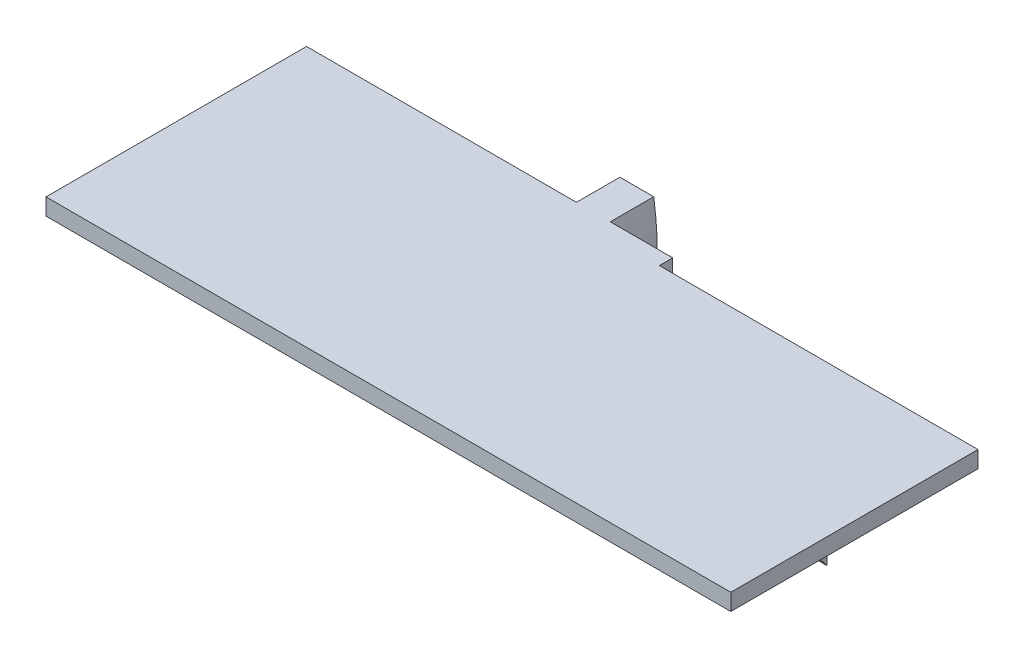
ISO-10303-21;
HEADER;
FILE_DESCRIPTION(('STEP AP214'),'2;1');
FILE_NAME('part.step','',(''),(''),'','','');
FILE_SCHEMA(('AUTOMOTIVE_DESIGN { 1 0 10303 214 1 1 1 1 }'));
ENDSEC;
DATA;
#1=APPLICATION_CONTEXT('core data for automotive mechanical design processes');
#2=APPLICATION_PROTOCOL_DEFINITION('international standard','automotive_design',2000,#1);
#3=PRODUCT_CONTEXT('',#1,'mechanical');
#4=PRODUCT('Part','Part','',(#3));
#5=PRODUCT_RELATED_PRODUCT_CATEGORY('part','',(#4));
#6=PRODUCT_DEFINITION_FORMATION('','',#4);
#7=PRODUCT_DEFINITION_CONTEXT('part definition',#1,'design');
#8=PRODUCT_DEFINITION('design','',#6,#7);
#9=PRODUCT_DEFINITION_SHAPE('','',#8);
#10=(LENGTH_UNIT() NAMED_UNIT(*) SI_UNIT(.MILLI.,.METRE.));
#11=(NAMED_UNIT(*) PLANE_ANGLE_UNIT() SI_UNIT($,.RADIAN.));
#12=(NAMED_UNIT(*) SI_UNIT($,.STERADIAN.) SOLID_ANGLE_UNIT());
#13=UNCERTAINTY_MEASURE_WITH_UNIT(LENGTH_MEASURE(1.E-05),#10,'distance_accuracy_value','');
#14=(GEOMETRIC_REPRESENTATION_CONTEXT(3) GLOBAL_UNCERTAINTY_ASSIGNED_CONTEXT((#13)) GLOBAL_UNIT_ASSIGNED_CONTEXT((#10,
#11,#12)) REPRESENTATION_CONTEXT('',''));
#15=CARTESIAN_POINT('',(0.,0.,0.));
#16=DIRECTION('',(0.,0.,1.));
#17=DIRECTION('',(1.,0.,0.));
#18=AXIS2_PLACEMENT_3D('',#15,#16,#17);
#19=CARTESIAN_POINT('',(-102.5,-9.,-52.));
#20=DIRECTION('',(0.,0.,1.));
#21=DIRECTION('',(1.,0.,0.));
#22=AXIS2_PLACEMENT_3D('',#19,#20,#21);
#23=CYLINDRICAL_SURFACE('',#22,82.);
#24=DIRECTION('',(0.,0.,1.));
#25=VECTOR('',#24,1.);
#26=CARTESIAN_POINT('',(-21.7039604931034,5.,-52.));
#27=LINE('',#26,#25);
#28=CARTESIAN_POINT('',(-21.7039604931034,5.,-47.));
#29=VERTEX_POINT('',#28);
#30=CARTESIAN_POINT('',(-21.7039604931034,5.,-39.));
#31=VERTEX_POINT('',#30);
#32=EDGE_CURVE('E255',#29,#31,#27,.T.);
#33=ORIENTED_EDGE('',*,*,#32,.F.);
#34=CARTESIAN_POINT('',(-102.5,-9.,-47.));
#35=DIRECTION('',(0.,0.,-1.));
#36=DIRECTION('',(-1.,0.,0.));
#37=AXIS2_PLACEMENT_3D('',#34,#35,#36);
#38=CIRCLE('',#37,82.);
#39=CARTESIAN_POINT('',(-20.5,-9.,-47.));
#40=VERTEX_POINT('',#39);
#41=EDGE_CURVE('E60',#29,#40,#38,.T.);
#42=ORIENTED_EDGE('',*,*,#41,.T.);
#43=DIRECTION('',(0.,0.,1.));
#44=VECTOR('',#43,1.);
#45=CARTESIAN_POINT('',(-20.5,-9.,-52.));
#46=LINE('',#45,#44);
#47=CARTESIAN_POINT('',(-20.5,-9.,-39.));
#48=VERTEX_POINT('',#47);
#49=EDGE_CURVE('E244',#40,#48,#46,.T.);
#50=ORIENTED_EDGE('',*,*,#49,.T.);
#51=CARTESIAN_POINT('',(-102.5,-9.,-39.));
#52=DIRECTION('',(0.,0.,-1.));
#53=DIRECTION('',(-1.,0.,0.));
#54=AXIS2_PLACEMENT_3D('',#51,#52,#53);
#55=CIRCLE('',#54,82.);
#56=CARTESIAN_POINT('',(-20.995398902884,0.,-39.));
#57=VERTEX_POINT('',#56);
#58=EDGE_CURVE('E239',#57,#48,#55,.T.);
#59=ORIENTED_EDGE('',*,*,#58,.F.);
#60=EDGE_CURVE('E230',#31,#57,#55,.T.);
#61=ORIENTED_EDGE('',*,*,#60,.F.);
#62=EDGE_LOOP('',(#33,#42,#50,#59,#61));
#63=FACE_BOUND('',#62,.T.);
#64=ADVANCED_FACE('F37',(#63),#23,.F.);
#65=CARTESIAN_POINT('',(102.5,5.,-39.));
#66=DIRECTION('',(0.,0.,1.));
#67=DIRECTION('',(1.,0.,0.));
#68=AXIS2_PLACEMENT_3D('',#65,#66,#67);
#69=PLANE('',#68);
#70=DIRECTION('',(-1.,0.,0.));
#71=VECTOR('',#70,1.);
#72=CARTESIAN_POINT('',(102.5,5.,-39.));
#73=LINE('',#72,#71);
#74=CARTESIAN_POINT('',(-102.5,5.,-39.));
#75=VERTEX_POINT('',#74);
#76=EDGE_CURVE('E198',#31,#75,#73,.T.);
#77=ORIENTED_EDGE('',*,*,#76,.F.);
#78=ORIENTED_EDGE('',*,*,#60,.T.);
#79=DIRECTION('',(-1.,0.,0.));
#80=VECTOR('',#79,1.);
#81=CARTESIAN_POINT('',(102.5,0.,-39.));
#82=LINE('',#81,#80);
#83=CARTESIAN_POINT('',(-102.5,0.,-39.));
#84=VERTEX_POINT('',#83);
#85=EDGE_CURVE('E209',#57,#84,#82,.T.);
#86=ORIENTED_EDGE('',*,*,#85,.T.);
#87=DIRECTION('',(0.,-1.,0.));
#88=VECTOR('',#87,1.);
#89=CARTESIAN_POINT('',(-102.5,5.,-39.));
#90=LINE('',#89,#88);
#91=EDGE_CURVE('E202',#75,#84,#90,.T.);
#92=ORIENTED_EDGE('',*,*,#91,.F.);
#93=EDGE_LOOP('',(#77,#78,#86,#92));
#94=FACE_BOUND('',#93,.T.);
#95=ADVANCED_FACE('F228',(#94),#69,.F.);
#96=CARTESIAN_POINT('',(102.5,5.,39.));
#97=DIRECTION('',(-1.,0.,0.));
#98=DIRECTION('',(0.,0.,1.));
#99=AXIS2_PLACEMENT_3D('',#96,#97,#98);
#100=PLANE('',#99);
#101=DIRECTION('',(0.,1.,0.));
#102=VECTOR('',#101,1.);
#103=CARTESIAN_POINT('',(102.5,0.,-35.));
#104=LINE('',#103,#102);
#105=CARTESIAN_POINT('',(102.5,0.,-35.));
#106=VERTEX_POINT('',#105);
#107=CARTESIAN_POINT('',(102.5,5.,-35.));
#108=VERTEX_POINT('',#107);
#109=EDGE_CURVE('E169',#106,#108,#104,.T.);
#110=ORIENTED_EDGE('',*,*,#109,.T.);
#111=DIRECTION('',(0.,0.,-1.));
#112=VECTOR('',#111,1.);
#113=CARTESIAN_POINT('',(102.5,5.,39.));
#114=LINE('',#113,#112);
#115=CARTESIAN_POINT('',(102.5,5.,39.));
#116=VERTEX_POINT('',#115);
#117=EDGE_CURVE('E195',#116,#108,#114,.T.);
#118=ORIENTED_EDGE('',*,*,#117,.F.);
#119=DIRECTION('',(0.,-1.,0.));
#120=VECTOR('',#119,1.);
#121=CARTESIAN_POINT('',(102.5,5.,39.));
#122=LINE('',#121,#120);
#123=CARTESIAN_POINT('',(102.5,0.,39.));
#124=VERTEX_POINT('',#123);
#125=EDGE_CURVE('E45',#116,#124,#122,.T.);
#126=ORIENTED_EDGE('',*,*,#125,.T.);
#127=DIRECTION('',(0.,0.,-1.));
#128=VECTOR('',#127,1.);
#129=CARTESIAN_POINT('',(102.5,0.,39.));
#130=LINE('',#129,#128);
#131=EDGE_CURVE('E207',#124,#106,#130,.T.);
#132=ORIENTED_EDGE('',*,*,#131,.T.);
#133=EDGE_LOOP('',(#110,#118,#126,#132));
#134=FACE_BOUND('',#133,.T.);
#135=ADVANCED_FACE('F217',(#134),#100,.F.);
#136=CARTESIAN_POINT('',(0.,5.,0.));
#137=DIRECTION('',(0.,1.,0.));
#138=DIRECTION('',(0.,0.,1.));
#139=AXIS2_PLACEMENT_3D('',#136,#137,#138);
#140=PLANE('',#139);
#141=ORIENTED_EDGE('',*,*,#117,.T.);
#142=DIRECTION('',(-1.,0.,0.));
#143=VECTOR('',#142,1.);
#144=CARTESIAN_POINT('',(0.,5.,-35.));
#145=LINE('',#144,#143);
#146=CARTESIAN_POINT('',(7.09999999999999,5.,-35.));
#147=VERTEX_POINT('',#146);
#148=EDGE_CURVE('E182',#108,#147,#145,.T.);
#149=ORIENTED_EDGE('',*,*,#148,.T.);
#150=DIRECTION('',(0.,0.,1.));
#151=VECTOR('',#150,1.);
#152=CARTESIAN_POINT('',(7.10000000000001,5.,0.));
#153=LINE('',#152,#151);
#154=CARTESIAN_POINT('',(7.09999999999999,5.,-39.));
#155=VERTEX_POINT('',#154);
#156=EDGE_CURVE('E179',#155,#147,#153,.T.);
#157=ORIENTED_EDGE('',*,*,#156,.F.);
#158=CARTESIAN_POINT('',(-11.5714566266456,5.,-39.));
#159=VERTEX_POINT('',#158);
#160=EDGE_CURVE('E199',#155,#159,#73,.T.);
#161=ORIENTED_EDGE('',*,*,#160,.T.);
#162=DIRECTION('',(0.,0.,1.));
#163=VECTOR('',#162,1.);
#164=CARTESIAN_POINT('',(-11.5714566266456,5.,-52.));
#165=LINE('',#164,#163);
#166=CARTESIAN_POINT('',(-11.5714566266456,5.,-52.));
#167=VERTEX_POINT('',#166);
#168=EDGE_CURVE('E183',#167,#159,#165,.T.);
#169=ORIENTED_EDGE('',*,*,#168,.F.);
#170=DIRECTION('',(1.,0.,0.));
#171=VECTOR('',#170,1.);
#172=CARTESIAN_POINT('',(0.,5.,-52.));
#173=LINE('',#172,#171);
#174=CARTESIAN_POINT('',(-21.7039604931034,5.,-52.));
#175=VERTEX_POINT('',#174);
#176=EDGE_CURVE('E247',#175,#167,#173,.T.);
#177=ORIENTED_EDGE('',*,*,#176,.F.);
#178=EDGE_CURVE('E252',#175,#29,#27,.T.);
#179=ORIENTED_EDGE('',*,*,#178,.T.);
#180=ORIENTED_EDGE('',*,*,#32,.T.);
#181=ORIENTED_EDGE('',*,*,#76,.T.);
#182=DIRECTION('',(0.,0.,1.));
#183=VECTOR('',#182,1.);
#184=CARTESIAN_POINT('',(-102.5,5.,39.));
#185=LINE('',#184,#183);
#186=CARTESIAN_POINT('',(-102.5,5.,39.));
#187=VERTEX_POINT('',#186);
#188=EDGE_CURVE('E189',#75,#187,#185,.T.);
#189=ORIENTED_EDGE('',*,*,#188,.T.);
#190=DIRECTION('',(1.,0.,0.));
#191=VECTOR('',#190,1.);
#192=CARTESIAN_POINT('',(102.5,5.,39.));
#193=LINE('',#192,#191);
#194=EDGE_CURVE('E192',#187,#116,#193,.T.);
#195=ORIENTED_EDGE('',*,*,#194,.T.);
#196=EDGE_LOOP('',(#141,#149,#157,#161,#169,#177,#179,#180,#181,#189,#195));
#197=FACE_BOUND('',#196,.T.);
#198=ADVANCED_FACE('F267',(#197),#140,.T.);
#199=CARTESIAN_POINT('',(0.,0.,0.));
#200=DIRECTION('',(0.,1.,0.));
#201=DIRECTION('',(0.,0.,1.));
#202=AXIS2_PLACEMENT_3D('',#199,#200,#201);
#203=PLANE('',#202);
#204=DIRECTION('',(-1.,0.,0.));
#205=VECTOR('',#204,1.);
#206=CARTESIAN_POINT('',(57.3,0.,1.99999999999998));
#207=LINE('',#206,#205);
#208=CARTESIAN_POINT('',(57.3,0.,1.99999999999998));
#209=VERTEX_POINT('',#208);
#210=CARTESIAN_POINT('',(52.3,0.,1.99999999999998));
#211=VERTEX_POINT('',#210);
#212=EDGE_CURVE('E165',#209,#211,#207,.T.);
#213=ORIENTED_EDGE('',*,*,#212,.F.);
#214=DIRECTION('',(0.,0.,1.));
#215=VECTOR('',#214,1.);
#216=CARTESIAN_POINT('',(57.3,0.,1.99999999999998));
#217=LINE('',#216,#215);
#218=CARTESIAN_POINT('',(57.3,0.,-35.));
#219=VERTEX_POINT('',#218);
#220=EDGE_CURVE('E150',#219,#209,#217,.T.);
#221=ORIENTED_EDGE('',*,*,#220,.F.);
#222=DIRECTION('',(-1.,0.,0.));
#223=VECTOR('',#222,1.);
#224=CARTESIAN_POINT('',(0.,0.,-35.));
#225=LINE('',#224,#223);
#226=EDGE_CURVE('E162',#106,#219,#225,.T.);
#227=ORIENTED_EDGE('',*,*,#226,.F.);
#228=ORIENTED_EDGE('',*,*,#131,.F.);
#229=DIRECTION('',(1.,0.,0.));
#230=VECTOR('',#229,1.);
#231=CARTESIAN_POINT('',(102.5,0.,39.));
#232=LINE('',#231,#230);
#233=CARTESIAN_POINT('',(-102.5,0.,39.));
#234=VERTEX_POINT('',#233);
#235=EDGE_CURVE('E205',#234,#124,#232,.T.);
#236=ORIENTED_EDGE('',*,*,#235,.F.);
#237=DIRECTION('',(0.,0.,1.));
#238=VECTOR('',#237,1.);
#239=CARTESIAN_POINT('',(-102.5,0.,39.));
#240=LINE('',#239,#238);
#241=EDGE_CURVE('E187',#84,#234,#240,.T.);
#242=ORIENTED_EDGE('',*,*,#241,.F.);
#243=ORIENTED_EDGE('',*,*,#85,.F.);
#244=CARTESIAN_POINT('',(-10.9412756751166,0.,-39.));
#245=VERTEX_POINT('',#244);
#246=EDGE_CURVE('E211',#245,#57,#82,.T.);
#247=ORIENTED_EDGE('',*,*,#246,.F.);
#248=CARTESIAN_POINT('',(7.09999999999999,0.,-39.));
#249=VERTEX_POINT('',#248);
#250=EDGE_CURVE('E193',#249,#245,#82,.T.);
#251=ORIENTED_EDGE('',*,*,#250,.F.);
#252=DIRECTION('',(0.,0.,1.));
#253=VECTOR('',#252,1.);
#254=CARTESIAN_POINT('',(7.10000000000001,0.,0.));
#255=LINE('',#254,#253);
#256=CARTESIAN_POINT('',(7.09999999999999,0.,-35.));
#257=VERTEX_POINT('',#256);
#258=EDGE_CURVE('E175',#249,#257,#255,.T.);
#259=ORIENTED_EDGE('',*,*,#258,.T.);
#260=CARTESIAN_POINT('',(52.3,0.,-35.));
#261=VERTEX_POINT('',#260);
#262=EDGE_CURVE('E171',#261,#257,#225,.T.);
#263=ORIENTED_EDGE('',*,*,#262,.F.);
#264=DIRECTION('',(0.,0.,1.));
#265=VECTOR('',#264,1.);
#266=CARTESIAN_POINT('',(52.3,0.,1.99999999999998));
#267=LINE('',#266,#265);
#268=EDGE_CURVE('E296',#261,#211,#267,.T.);
#269=ORIENTED_EDGE('',*,*,#268,.T.);
#270=EDGE_LOOP('',(#213,#221,#227,#228,#236,#242,#243,#247,#251,#259,#263,#269));
#271=FACE_BOUND('',#270,.T.);
#272=ADVANCED_FACE('F160',(#271),#203,.F.);
#273=CARTESIAN_POINT('',(-102.5,5.,39.));
#274=DIRECTION('',(1.,0.,0.));
#275=DIRECTION('',(0.,0.,-1.));
#276=AXIS2_PLACEMENT_3D('',#273,#274,#275);
#277=PLANE('',#276);
#278=ORIENTED_EDGE('',*,*,#241,.T.);
#279=DIRECTION('',(0.,-1.,0.));
#280=VECTOR('',#279,1.);
#281=CARTESIAN_POINT('',(-102.5,5.,39.));
#282=LINE('',#281,#280);
#283=EDGE_CURVE('E11',#187,#234,#282,.T.);
#284=ORIENTED_EDGE('',*,*,#283,.F.);
#285=ORIENTED_EDGE('',*,*,#188,.F.);
#286=ORIENTED_EDGE('',*,*,#91,.T.);
#287=EDGE_LOOP('',(#278,#284,#285,#286));
#288=FACE_BOUND('',#287,.T.);
#289=ADVANCED_FACE('F39',(#288),#277,.F.);
#290=CARTESIAN_POINT('',(102.5,5.,39.));
#291=DIRECTION('',(0.,0.,-1.));
#292=DIRECTION('',(-1.,0.,0.));
#293=AXIS2_PLACEMENT_3D('',#290,#291,#292);
#294=PLANE('',#293);
#295=ORIENTED_EDGE('',*,*,#235,.T.);
#296=ORIENTED_EDGE('',*,*,#125,.F.);
#297=ORIENTED_EDGE('',*,*,#194,.F.);
#298=ORIENTED_EDGE('',*,*,#283,.T.);
#299=EDGE_LOOP('',(#295,#296,#297,#298));
#300=FACE_BOUND('',#299,.T.);
#301=ADVANCED_FACE('F222',(#300),#294,.F.);
#302=CARTESIAN_POINT('',(-102.5,-9.,-39.));
#303=DIRECTION('',(0.,0.,-1.));
#304=DIRECTION('',(-1.,0.,0.));
#305=AXIS2_PLACEMENT_3D('',#302,#303,#304);
#306=CIRCLE('',#305,92.);
#307=EDGE_CURVE('E248',#159,#245,#306,.T.);
#308=ORIENTED_EDGE('',*,*,#307,.F.);
#309=ORIENTED_EDGE('',*,*,#160,.F.);
#310=DIRECTION('',(0.,1.,0.));
#311=VECTOR('',#310,1.);
#312=CARTESIAN_POINT('',(7.09999999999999,0.,-39.));
#313=LINE('',#312,#311);
#314=EDGE_CURVE('E170',#249,#155,#313,.T.);
#315=ORIENTED_EDGE('',*,*,#314,.F.);
#316=ORIENTED_EDGE('',*,*,#250,.T.);
#317=EDGE_LOOP('',(#308,#309,#315,#316));
#318=FACE_BOUND('',#317,.T.);
#319=ADVANCED_FACE('F273',(#318),#69,.F.);
#320=CARTESIAN_POINT('',(0.,0.,-35.));
#321=DIRECTION('',(0.,0.,-1.));
#322=DIRECTION('',(-1.,0.,0.));
#323=AXIS2_PLACEMENT_3D('',#320,#321,#322);
#324=PLANE('',#323);
#325=ORIENTED_EDGE('',*,*,#148,.F.);
#326=ORIENTED_EDGE('',*,*,#109,.F.);
#327=ORIENTED_EDGE('',*,*,#226,.T.);
#328=DIRECTION('',(0.,1.,0.));
#329=VECTOR('',#328,1.);
#330=CARTESIAN_POINT('',(57.3,0.,-35.));
#331=LINE('',#330,#329);
#332=CARTESIAN_POINT('',(57.3,-47.7,-35.));
#333=VERTEX_POINT('',#332);
#334=EDGE_CURVE('E147',#333,#219,#331,.T.);
#335=ORIENTED_EDGE('',*,*,#334,.F.);
#336=DIRECTION('',(-1.,0.,0.));
#337=VECTOR('',#336,1.);
#338=CARTESIAN_POINT('',(57.3,-47.7,-35.));
#339=LINE('',#338,#337);
#340=CARTESIAN_POINT('',(52.3,-47.7,-35.));
#341=VERTEX_POINT('',#340);
#342=EDGE_CURVE('E293',#333,#341,#339,.T.);
#343=ORIENTED_EDGE('',*,*,#342,.T.);
#344=DIRECTION('',(0.,1.,0.));
#345=VECTOR('',#344,1.);
#346=CARTESIAN_POINT('',(52.3,0.,-35.));
#347=LINE('',#346,#345);
#348=EDGE_CURVE('E52',#341,#261,#347,.T.);
#349=ORIENTED_EDGE('',*,*,#348,.T.);
#350=ORIENTED_EDGE('',*,*,#262,.T.);
#351=DIRECTION('',(0.,1.,0.));
#352=VECTOR('',#351,1.);
#353=CARTESIAN_POINT('',(7.09999999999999,0.,-35.));
#354=LINE('',#353,#352);
#355=EDGE_CURVE('E173',#257,#147,#354,.T.);
#356=ORIENTED_EDGE('',*,*,#355,.T.);
#357=EDGE_LOOP('',(#325,#326,#327,#335,#343,#349,#350,#356));
#358=FACE_BOUND('',#357,.T.);
#359=ADVANCED_FACE('F167',(#358),#324,.T.);
#360=CARTESIAN_POINT('',(7.10000000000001,0.,0.));
#361=DIRECTION('',(-1.,0.,0.));
#362=DIRECTION('',(0.,0.,1.));
#363=AXIS2_PLACEMENT_3D('',#360,#361,#362);
#364=PLANE('',#363);
#365=ORIENTED_EDGE('',*,*,#156,.T.);
#366=ORIENTED_EDGE('',*,*,#355,.F.);
#367=ORIENTED_EDGE('',*,*,#258,.F.);
#368=ORIENTED_EDGE('',*,*,#314,.T.);
#369=EDGE_LOOP('',(#365,#366,#367,#368));
#370=FACE_BOUND('',#369,.T.);
#371=ADVANCED_FACE('F337',(#370),#364,.F.);
#372=CARTESIAN_POINT('',(0.,0.,-39.));
#373=DIRECTION('',(0.,0.,-1.));
#374=DIRECTION('',(-1.,0.,0.));
#375=AXIS2_PLACEMENT_3D('',#372,#373,#374);
#376=PLANE('',#375);
#377=CARTESIAN_POINT('',(-10.5,-9.,-39.));
#378=VERTEX_POINT('',#377);
#379=EDGE_CURVE('E241',#245,#378,#306,.T.);
#380=ORIENTED_EDGE('',*,*,#379,.F.);
#381=ORIENTED_EDGE('',*,*,#246,.T.);
#382=ORIENTED_EDGE('',*,*,#58,.T.);
#383=DIRECTION('',(1.,0.,0.));
#384=VECTOR('',#383,1.);
#385=CARTESIAN_POINT('',(0.,-8.99999999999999,-39.));
#386=LINE('',#385,#384);
#387=EDGE_CURVE('E245',#48,#378,#386,.T.);
#388=ORIENTED_EDGE('',*,*,#387,.T.);
#389=EDGE_LOOP('',(#380,#381,#382,#388));
#390=FACE_BOUND('',#389,.T.);
#391=ADVANCED_FACE('F237',(#390),#376,.F.);
#392=CARTESIAN_POINT('',(-102.5,-9.,-52.));
#393=DIRECTION('',(0.,0.,1.));
#394=DIRECTION('',(1.,0.,0.));
#395=AXIS2_PLACEMENT_3D('',#392,#393,#394);
#396=CYLINDRICAL_SURFACE('',#395,92.);
#397=ORIENTED_EDGE('',*,*,#307,.T.);
#398=ORIENTED_EDGE('',*,*,#379,.T.);
#399=DIRECTION('',(0.,0.,1.));
#400=VECTOR('',#399,1.);
#401=CARTESIAN_POINT('',(-10.5,-9.,-52.));
#402=LINE('',#401,#400);
#403=CARTESIAN_POINT('',(-10.5,-9.,-52.));
#404=VERTEX_POINT('',#403);
#405=EDGE_CURVE('E257',#404,#378,#402,.T.);
#406=ORIENTED_EDGE('',*,*,#405,.F.);
#407=CARTESIAN_POINT('',(-102.5,-9.,-52.));
#408=DIRECTION('',(0.,0.,-1.));
#409=DIRECTION('',(-1.,0.,0.));
#410=AXIS2_PLACEMENT_3D('',#407,#408,#409);
#411=CIRCLE('',#410,92.);
#412=EDGE_CURVE('E264',#167,#404,#411,.T.);
#413=ORIENTED_EDGE('',*,*,#412,.F.);
#414=ORIENTED_EDGE('',*,*,#168,.T.);
#415=EDGE_LOOP('',(#397,#398,#406,#413,#414));
#416=FACE_BOUND('',#415,.T.);
#417=ADVANCED_FACE('F262',(#416),#396,.T.);
#418=CARTESIAN_POINT('',(0.,-8.99999999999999,-52.));
#419=DIRECTION('',(0.,-1.,0.));
#420=DIRECTION('',(1.,0.,0.));
#421=AXIS2_PLACEMENT_3D('',#418,#419,#420);
#422=PLANE('',#421);
#423=ORIENTED_EDGE('',*,*,#387,.F.);
#424=ORIENTED_EDGE('',*,*,#49,.F.);
#425=DIRECTION('',(1.,0.,0.));
#426=VECTOR('',#425,1.);
#427=CARTESIAN_POINT('',(0.,-9.,-47.));
#428=LINE('',#427,#426);
#429=CARTESIAN_POINT('',(-30.5,-9.,-47.));
#430=VERTEX_POINT('',#429);
#431=EDGE_CURVE('E288',#430,#40,#428,.T.);
#432=ORIENTED_EDGE('',*,*,#431,.F.);
#433=DIRECTION('',(0.,0.,1.));
#434=VECTOR('',#433,1.);
#435=CARTESIAN_POINT('',(-30.5,-9.,-69.2046505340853));
#436=LINE('',#435,#434);
#437=CARTESIAN_POINT('',(-30.5,-9.,-52.));
#438=VERTEX_POINT('',#437);
#439=EDGE_CURVE('E274',#438,#430,#436,.T.);
#440=ORIENTED_EDGE('',*,*,#439,.F.);
#441=DIRECTION('',(1.,0.,0.));
#442=VECTOR('',#441,1.);
#443=CARTESIAN_POINT('',(0.,-8.99999999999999,-52.));
#444=LINE('',#443,#442);
#445=EDGE_CURVE('E276',#438,#404,#444,.T.);
#446=ORIENTED_EDGE('',*,*,#445,.T.);
#447=ORIENTED_EDGE('',*,*,#405,.T.);
#448=EDGE_LOOP('',(#423,#424,#432,#440,#446,#447));
#449=FACE_BOUND('',#448,.T.);
#450=ADVANCED_FACE('F328',(#449),#422,.T.);
#451=CARTESIAN_POINT('',(0.,0.,-52.));
#452=DIRECTION('',(0.,0.,-1.));
#453=DIRECTION('',(-1.,0.,0.));
#454=AXIS2_PLACEMENT_3D('',#451,#452,#453);
#455=PLANE('',#454);
#456=ORIENTED_EDGE('',*,*,#176,.T.);
#457=ORIENTED_EDGE('',*,*,#412,.T.);
#458=ORIENTED_EDGE('',*,*,#445,.F.);
#459=DIRECTION('',(-0.531999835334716,-0.846744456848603,0.));
#460=VECTOR('',#459,1.);
#461=CARTESIAN_POINT('',(-17.8135621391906,11.1920568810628,-52.));
#462=LINE('',#461,#460);
#463=EDGE_CURVE('E282',#175,#438,#462,.T.);
#464=ORIENTED_EDGE('',*,*,#463,.F.);
#465=EDGE_LOOP('',(#456,#457,#458,#464));
#466=FACE_BOUND('',#465,.T.);
#467=ADVANCED_FACE('F331',(#466),#455,.T.);
#468=CARTESIAN_POINT('',(0.,0.,-47.));
#469=DIRECTION('',(0.,0.,-1.));
#470=DIRECTION('',(-1.,0.,0.));
#471=AXIS2_PLACEMENT_3D('',#468,#469,#470);
#472=PLANE('',#471);
#473=DIRECTION('',(-0.531999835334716,-0.846744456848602,0.));
#474=VECTOR('',#473,1.);
#475=CARTESIAN_POINT('',(-17.8135621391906,11.1920568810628,-47.));
#476=LINE('',#475,#474);
#477=EDGE_CURVE('E285',#29,#430,#476,.T.);
#478=ORIENTED_EDGE('',*,*,#477,.T.);
#479=ORIENTED_EDGE('',*,*,#431,.T.);
#480=ORIENTED_EDGE('',*,*,#41,.F.);
#481=EDGE_LOOP('',(#478,#479,#480));
#482=FACE_BOUND('',#481,.T.);
#483=ADVANCED_FACE('F314',(#482),#472,.F.);
#484=CARTESIAN_POINT('',(-17.8135621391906,11.1920568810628,-69.2046505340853));
#485=DIRECTION('',(-0.846744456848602,0.531999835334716,0.));
#486=DIRECTION('',(-0.531999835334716,-0.846744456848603,0.));
#487=AXIS2_PLACEMENT_3D('',#484,#485,#486);
#488=PLANE('',#487);
#489=ORIENTED_EDGE('',*,*,#178,.F.);
#490=ORIENTED_EDGE('',*,*,#463,.T.);
#491=ORIENTED_EDGE('',*,*,#439,.T.);
#492=ORIENTED_EDGE('',*,*,#477,.F.);
#493=EDGE_LOOP('',(#489,#490,#491,#492));
#494=FACE_BOUND('',#493,.T.);
#495=ADVANCED_FACE('F307',(#494),#488,.T.);
#496=CARTESIAN_POINT('',(57.3,-47.7,-35.));
#497=DIRECTION('',(0.,0.612907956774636,-0.790154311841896));
#498=DIRECTION('',(0.,0.790154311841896,0.612907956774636));
#499=AXIS2_PLACEMENT_3D('',#496,#497,#498);
#500=PLANE('',#499);
#501=DIRECTION('',(0.,-0.790154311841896,-0.612907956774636));
#502=VECTOR('',#501,1.);
#503=CARTESIAN_POINT('',(52.3,-47.7,-35.));
#504=LINE('',#503,#502);
#505=EDGE_CURVE('E155',#211,#341,#504,.T.);
#506=ORIENTED_EDGE('',*,*,#505,.T.);
#507=ORIENTED_EDGE('',*,*,#342,.F.);
#508=DIRECTION('',(0.,-0.790154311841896,-0.612907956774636));
#509=VECTOR('',#508,1.);
#510=CARTESIAN_POINT('',(57.3,-47.7,-35.));
#511=LINE('',#510,#509);
#512=EDGE_CURVE('E152',#209,#333,#511,.T.);
#513=ORIENTED_EDGE('',*,*,#512,.F.);
#514=ORIENTED_EDGE('',*,*,#212,.T.);
#515=EDGE_LOOP('',(#506,#507,#513,#514));
#516=FACE_BOUND('',#515,.T.);
#517=ADVANCED_FACE('F305',(#516),#500,.F.);
#518=CARTESIAN_POINT('',(57.3,0.,0.));
#519=DIRECTION('',(1.,0.,0.));
#520=DIRECTION('',(0.,0.,-1.));
#521=AXIS2_PLACEMENT_3D('',#518,#519,#520);
#522=PLANE('',#521);
#523=ORIENTED_EDGE('',*,*,#334,.T.);
#524=ORIENTED_EDGE('',*,*,#220,.T.);
#525=ORIENTED_EDGE('',*,*,#512,.T.);
#526=EDGE_LOOP('',(#523,#524,#525));
#527=FACE_BOUND('',#526,.T.);
#528=ADVANCED_FACE('F149',(#527),#522,.T.);
#529=CARTESIAN_POINT('',(52.3,0.,0.));
#530=DIRECTION('',(1.,0.,0.));
#531=DIRECTION('',(0.,0.,-1.));
#532=AXIS2_PLACEMENT_3D('',#529,#530,#531);
#533=PLANE('',#532);
#534=ORIENTED_EDGE('',*,*,#348,.F.);
#535=ORIENTED_EDGE('',*,*,#505,.F.);
#536=ORIENTED_EDGE('',*,*,#268,.F.);
#537=EDGE_LOOP('',(#534,#535,#536));
#538=FACE_BOUND('',#537,.T.);
#539=ADVANCED_FACE('F303',(#538),#533,.F.);
#540=CLOSED_SHELL('',(#64,#95,#135,#198,#272,#289,#301,#319,#359,#371,#391,#417,#450,#467,#483,
#495,#517,#528,#539));
#541=MANIFOLD_SOLID_BREP('B2',#540);
#542=ADVANCED_BREP_SHAPE_REPRESENTATION('',(#18,#541),#14);
#543=SHAPE_DEFINITION_REPRESENTATION(#9,#542);
ENDSEC;
END-ISO-10303-21;
